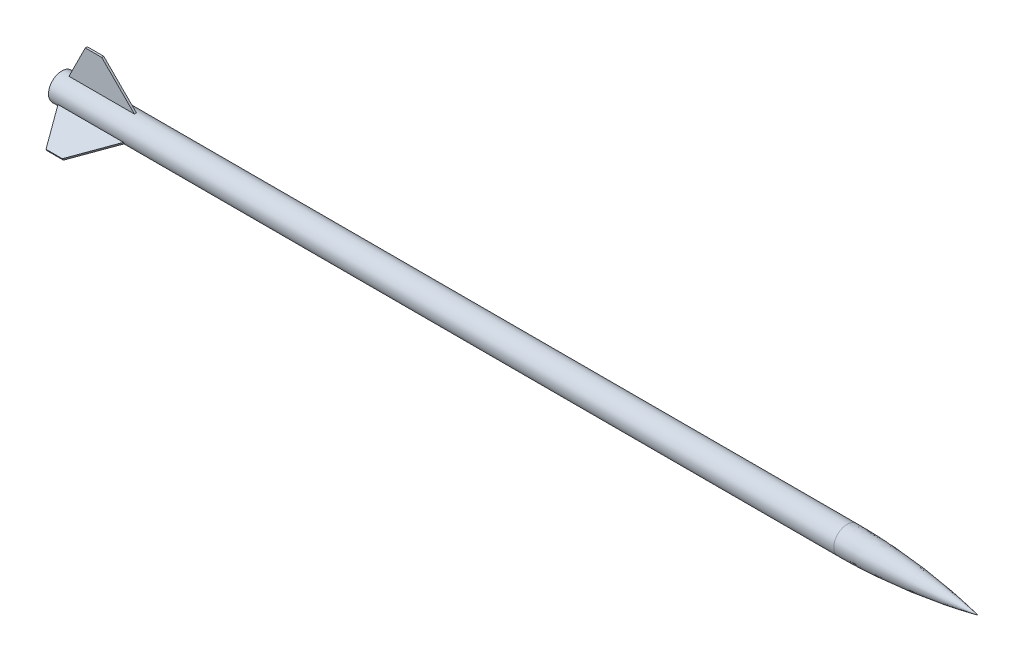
from build123d import *

# Parameters (mm, degrees)
SKETCH1_R         = 6.8834
EXTRUDE1_DEPTH    = 406.4
EXTRUDE3_DEPTH    = 0.529166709
CIRPATTERN2_COUNT = 3


with BuildPart() as part:
    # Sketch1 → Extrude1 (new body)
    with BuildSketch(Plane(origin=(0, 0, 0), x_dir=(0, 0, -1), z_dir=(1, 0, 0))):
        Circle(SKETCH1_R)
    extrude(amount=EXTRUDE1_DEPTH)

    # Sketch2 → Extrude3 (add, symmetric)
    with BuildSketch(Plane.XY):
        Polygon((4.233333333, 6.864871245), (12.7, 23.798204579), (21.166666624, 23.798204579), (38.1, 6.864871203), (38.1, 5.337919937), (4.233333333, 5.337919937), align=None)
    extrude3 = extrude(amount=EXTRUDE3_DEPTH, both=True)

    # CirPattern2: Extrude3 ×3 about axis
    cirpattern2_axis = Axis((0, 0, 0), (1, 0, 0))
    for i in range(1, CIRPATTERN2_COUNT):
        add(extrude3.rotate(cirpattern2_axis, i * 360 / CIRPATTERN2_COUNT))

    # Sketch4 → Revolve2 (revolve)
    with BuildSketch(Plane.XY):
        with BuildLine():
            Line((406.4, 0), (474.133333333, 0))
            ThreePointArc((474.133333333, 0), (440.441098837, 5.158129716), (406.4, 6.8834))
            Line((406.4, 6.8834), (406.4, 0))
        make_face()
    revolve(axis=Axis((0, 0, 0), (1, 0, 0)))


solid = part.part
